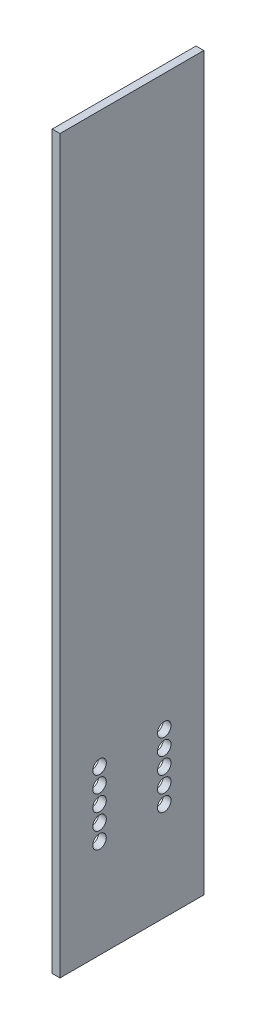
from build123d import *

# Parameters (mm, degrees)
SKETCH1_W                  = 56.4388
SKETCH1_H                  = 287.02
BOSS_EXTRUDE1_DEPTH        = 3.048
F_4_0_209_DIAMETER_HOLE1_D = 5.3086
LPATTERN1_COUNT            = 4
LPATTERN1_PITCH            = 6.35
LPATTERN1_COL_COUNT        = 2
LPATTERN1_COL_PITCH        = 6.35


with BuildPart() as part:
    # Sketch1 → Boss-Extrude1 (new body)
    with BuildSketch(Plane(origin=(0, 0, 0), x_dir=(0, 0, -1), z_dir=(1, 0, 0))):
        Rectangle(SKETCH1_W, SKETCH1_H)
    extrude(amount=BOSS_EXTRUDE1_DEPTH)

    # 4 _0.209_ Diameter Hole1 (through all)
    with Locations(Plane(origin=(3.048, 0, 0), x_dir=(0, 0, -1), z_dir=(1, 0, 0))):
        with Locations((-12.7, -98.5012), (12.7, -98.5012)):
            f_4_0_209_diameter_hole1 = Hole(F_4_0_209_DIAMETER_HOLE1_D / 2)

    # LPattern1: 4 _0.209_ Diameter Hole1 ×4
    with Locations(*[(0, i * LPATTERN1_PITCH, 0) for i in range(1, LPATTERN1_COUNT)]):
        add(f_4_0_209_diameter_hole1, mode=Mode.SUBTRACT)

    # LPattern1 col: 4 _0.209_ Diameter Hole1 ×2
    with Locations(*[(0, -i * LPATTERN1_COL_PITCH, 0) for i in range(1, LPATTERN1_COL_COUNT)]):
        add(f_4_0_209_diameter_hole1, mode=Mode.SUBTRACT)


solid = part.part
